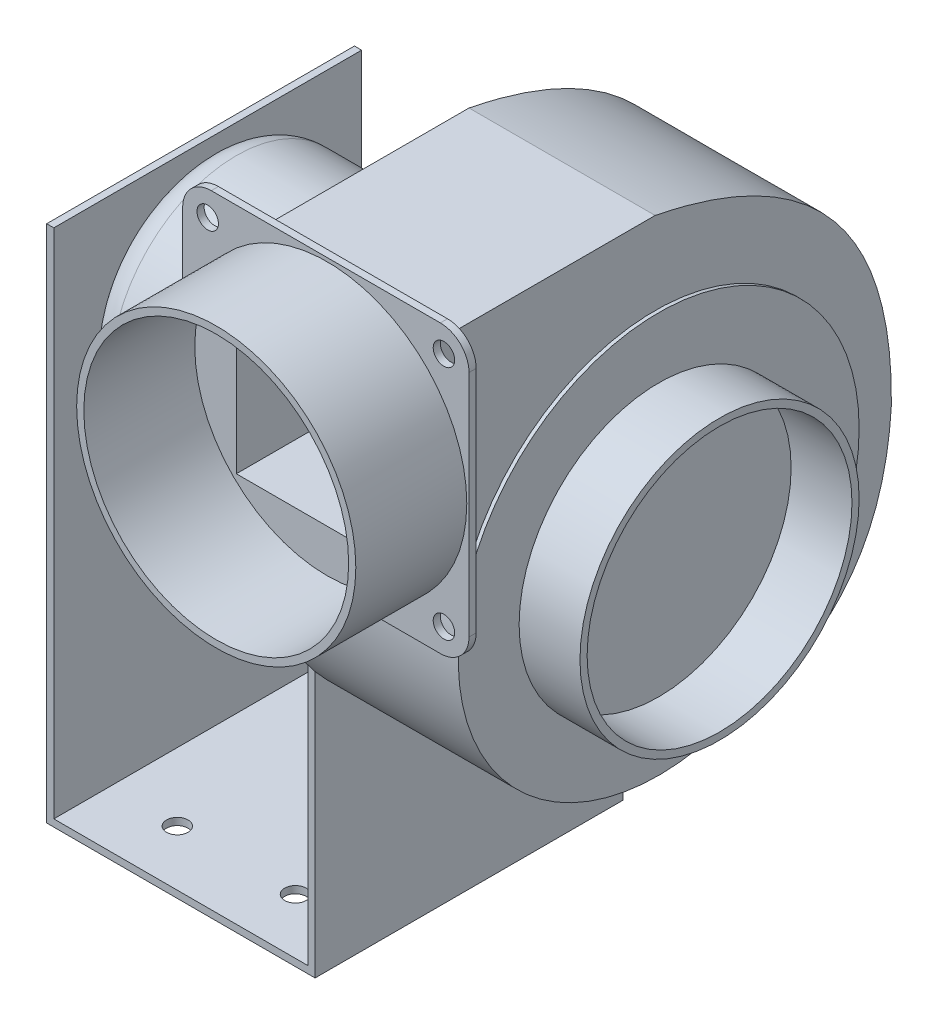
ISO-10303-21;
HEADER;
FILE_DESCRIPTION(('STEP AP214'),'2;1');
FILE_NAME('part.step','',(''),(''),'','','');
FILE_SCHEMA(('AUTOMOTIVE_DESIGN { 1 0 10303 214 1 1 1 1 }'));
ENDSEC;
DATA;
#1=APPLICATION_CONTEXT('core data for automotive mechanical design processes');
#2=APPLICATION_PROTOCOL_DEFINITION('international standard','automotive_design',2000,#1);
#3=PRODUCT_CONTEXT('',#1,'mechanical');
#4=PRODUCT('Part','Part','',(#3));
#5=PRODUCT_RELATED_PRODUCT_CATEGORY('part','',(#4));
#6=PRODUCT_DEFINITION_FORMATION('','',#4);
#7=PRODUCT_DEFINITION_CONTEXT('part definition',#1,'design');
#8=PRODUCT_DEFINITION('design','',#6,#7);
#9=PRODUCT_DEFINITION_SHAPE('','',#8);
#10=(LENGTH_UNIT() NAMED_UNIT(*) SI_UNIT(.MILLI.,.METRE.));
#11=(NAMED_UNIT(*) PLANE_ANGLE_UNIT() SI_UNIT($,.RADIAN.));
#12=(NAMED_UNIT(*) SI_UNIT($,.STERADIAN.) SOLID_ANGLE_UNIT());
#13=UNCERTAINTY_MEASURE_WITH_UNIT(LENGTH_MEASURE(1.E-05),#10,'distance_accuracy_value','');
#14=(GEOMETRIC_REPRESENTATION_CONTEXT(3) GLOBAL_UNCERTAINTY_ASSIGNED_CONTEXT((#13)) GLOBAL_UNIT_ASSIGNED_CONTEXT((#10,
#11,#12)) REPRESENTATION_CONTEXT('',''));
#15=CARTESIAN_POINT('',(0.,0.,0.));
#16=DIRECTION('',(0.,0.,1.));
#17=DIRECTION('',(1.,0.,0.));
#18=AXIS2_PLACEMENT_3D('',#15,#16,#17);
#19=CARTESIAN_POINT('',(0.,52.6511777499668,-49.9638222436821));
#20=DIRECTION('',(1.,0.,0.));
#21=DIRECTION('',(0.,0.,-1.));
#22=AXIS2_PLACEMENT_3D('',#19,#20,#21);
#23=PLANE('',#22);
#24=DIRECTION('',(0.,-1.,0.));
#25=VECTOR('',#24,1.);
#26=CARTESIAN_POINT('',(0.,35.,-43.));
#27=LINE('',#26,#25);
#28=CARTESIAN_POINT('',(0.,35.,-43.));
#29=VERTEX_POINT('',#28);
#30=CARTESIAN_POINT('',(0.,-46.4801190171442,-42.9999999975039));
#31=VERTEX_POINT('',#30);
#32=EDGE_CURVE('E50',#29,#31,#27,.T.);
#33=ORIENTED_EDGE('',*,*,#32,.F.);
#34=DIRECTION('',(0.,0.,-1.));
#35=VECTOR('',#34,1.);
#36=CARTESIAN_POINT('',(0.,35.,-43.));
#37=LINE('',#36,#35);
#38=CARTESIAN_POINT('',(0.,35.,43.));
#39=VERTEX_POINT('',#38);
#40=EDGE_CURVE('E282',#39,#29,#37,.T.);
#41=ORIENTED_EDGE('',*,*,#40,.F.);
#42=DIRECTION('',(0.,-1.,0.));
#43=VECTOR('',#42,1.);
#44=CARTESIAN_POINT('',(0.,35.,43.));
#45=LINE('',#44,#43);
#46=CARTESIAN_POINT('',(0.,-35.8747822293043,43.));
#47=VERTEX_POINT('',#46);
#48=EDGE_CURVE('E228',#39,#47,#45,.T.);
#49=ORIENTED_EDGE('',*,*,#48,.T.);
#50=CARTESIAN_POINT('',(0.,0.,0.));
#51=DIRECTION('',(1.,0.,0.));
#52=DIRECTION('',(0.,0.,-1.));
#53=AXIS2_PLACEMENT_3D('',#50,#51,#52);
#54=CIRCLE('',#53,56.);
#55=CARTESIAN_POINT('',(0.,19.,52.6782687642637));
#56=VERTEX_POINT('',#55);
#57=EDGE_CURVE('E490',#56,#47,#54,.T.);
#58=ORIENTED_EDGE('',*,*,#57,.F.);
#59=DIRECTION('',(0.,0.,-1.));
#60=VECTOR('',#59,1.);
#61=CARTESIAN_POINT('',(0.,19.,64.));
#62=LINE('',#61,#60);
#63=CARTESIAN_POINT('',(0.,19.,64.));
#64=VERTEX_POINT('',#63);
#65=EDGE_CURVE('E488',#64,#56,#62,.T.);
#66=ORIENTED_EDGE('',*,*,#65,.F.);
#67=DIRECTION('',(0.,-1.,0.));
#68=VECTOR('',#67,1.);
#69=CARTESIAN_POINT('',(0.,79.,64.));
#70=LINE('',#69,#68);
#71=CARTESIAN_POINT('',(0.,79.,64.));
#72=VERTEX_POINT('',#71);
#73=EDGE_CURVE('E485',#72,#64,#70,.T.);
#74=ORIENTED_EDGE('',*,*,#73,.F.);
#75=DIRECTION('',(0.,0.,1.));
#76=VECTOR('',#75,1.);
#77=CARTESIAN_POINT('',(0.,79.,0.));
#78=LINE('',#77,#76);
#79=CARTESIAN_POINT('',(0.,79.,0.));
#80=VERTEX_POINT('',#79);
#81=EDGE_CURVE('E480',#80,#72,#78,.T.);
#82=ORIENTED_EDGE('',*,*,#81,.F.);
#83=CARTESIAN_POINT('',(0.,0.,-66.));
#84=CARTESIAN_POINT('',(0.,65.8023554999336,-66.9276444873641));
#85=CARTESIAN_POINT('',(0.,79.,0.));
#86=B_SPLINE_CURVE_WITH_KNOTS('',2,(#83,#84,#85),.UNSPECIFIED.,.F.,.F.,(3,3),(0.,1.),.UNSPECIFIED.);
#87=CARTESIAN_POINT('',(0.,0.,-66.));
#88=VERTEX_POINT('',#87);
#89=EDGE_CURVE('E428',#88,#80,#86,.T.);
#90=ORIENTED_EDGE('',*,*,#89,.F.);
#91=CARTESIAN_POINT('',(0.,-56.,0.));
#92=CARTESIAN_POINT('',(0.,-57.8373750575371,-62.6147042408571));
#93=CARTESIAN_POINT('',(0.,0.,-66.));
#94=B_SPLINE_CURVE_WITH_KNOTS('',2,(#91,#92,#93),.UNSPECIFIED.,.F.,.F.,(3,3),(0.,1.),.UNSPECIFIED.);
#95=EDGE_CURVE('E493',#31,#88,#94,.T.);
#96=ORIENTED_EDGE('',*,*,#95,.F.);
#97=EDGE_LOOP('',(#33,#41,#49,#58,#66,#74,#82,#90,#96));
#98=FACE_BOUND('',#97,.T.);
#99=ADVANCED_FACE('F35',(#98),#23,.F.);
#100=CARTESIAN_POINT('',(-5.99999999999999,17.,66.));
#101=DIRECTION('',(0.,0.,-1.));
#102=DIRECTION('',(-1.,0.,0.));
#103=AXIS2_PLACEMENT_3D('',#100,#101,#102);
#104=PLANE('',#103);
#105=CARTESIAN_POINT('',(-6.99999999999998,16.,66.));
#106=DIRECTION('',(0.,0.,1.));
#107=DIRECTION('',(1.,0.,0.));
#108=AXIS2_PLACEMENT_3D('',#105,#106,#107);
#109=CIRCLE('',#108,3.);
#110=CARTESIAN_POINT('',(-3.99999999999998,16.,66.));
#111=VERTEX_POINT('',#110);
#112=EDGE_CURVE('E346',#111,#111,#109,.T.);
#113=ORIENTED_EDGE('',*,*,#112,.F.);
#114=EDGE_LOOP('',(#113));
#115=FACE_BOUND('',#114,.T.);
#116=CARTESIAN_POINT('',(59.,16.,66.));
#117=DIRECTION('',(0.,0.,1.));
#118=DIRECTION('',(1.,0.,0.));
#119=AXIS2_PLACEMENT_3D('',#116,#117,#118);
#120=CIRCLE('',#119,3.);
#121=CARTESIAN_POINT('',(62.,16.,66.));
#122=VERTEX_POINT('',#121);
#123=EDGE_CURVE('E350',#122,#122,#120,.T.);
#124=ORIENTED_EDGE('',*,*,#123,.F.);
#125=EDGE_LOOP('',(#124));
#126=FACE_BOUND('',#125,.T.);
#127=CARTESIAN_POINT('',(59.,82.,66.));
#128=DIRECTION('',(0.,0.,1.));
#129=DIRECTION('',(1.,0.,0.));
#130=AXIS2_PLACEMENT_3D('',#127,#128,#129);
#131=CIRCLE('',#130,3.);
#132=CARTESIAN_POINT('',(62.,82.,66.));
#133=VERTEX_POINT('',#132);
#134=EDGE_CURVE('E356',#133,#133,#131,.T.);
#135=ORIENTED_EDGE('',*,*,#134,.F.);
#136=EDGE_LOOP('',(#135));
#137=FACE_BOUND('',#136,.T.);
#138=CARTESIAN_POINT('',(-6.99999999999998,82.,66.));
#139=DIRECTION('',(0.,0.,1.));
#140=DIRECTION('',(1.,0.,0.));
#141=AXIS2_PLACEMENT_3D('',#138,#139,#140);
#142=CIRCLE('',#141,3.);
#143=CARTESIAN_POINT('',(-3.99999999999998,82.,66.));
#144=VERTEX_POINT('',#143);
#145=EDGE_CURVE('E362',#144,#144,#142,.T.);
#146=ORIENTED_EDGE('',*,*,#145,.F.);
#147=EDGE_LOOP('',(#146));
#148=FACE_BOUND('',#147,.T.);
#149=CARTESIAN_POINT('',(-5.99999999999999,17.,66.));
#150=DIRECTION('',(0.,0.,1.));
#151=DIRECTION('',(-1.,0.,0.));
#152=AXIS2_PLACEMENT_3D('',#149,#150,#151);
#153=CIRCLE('',#152,8.);
#154=CARTESIAN_POINT('',(-14.,17.0000000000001,66.));
#155=VERTEX_POINT('',#154);
#156=CARTESIAN_POINT('',(-5.99999999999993,9.,66.));
#157=VERTEX_POINT('',#156);
#158=EDGE_CURVE('E371',#155,#157,#153,.T.);
#159=ORIENTED_EDGE('',*,*,#158,.T.);
#160=DIRECTION('',(1.,0.,0.));
#161=VECTOR('',#160,1.);
#162=CARTESIAN_POINT('',(-5.99999999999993,9.,66.));
#163=LINE('',#162,#161);
#164=CARTESIAN_POINT('',(58.,9.,66.));
#165=VERTEX_POINT('',#164);
#166=EDGE_CURVE('E374',#157,#165,#163,.T.);
#167=ORIENTED_EDGE('',*,*,#166,.T.);
#168=CARTESIAN_POINT('',(58.,17.,66.));
#169=DIRECTION('',(0.,0.,1.));
#170=DIRECTION('',(1.,0.,0.));
#171=AXIS2_PLACEMENT_3D('',#168,#169,#170);
#172=CIRCLE('',#171,8.);
#173=CARTESIAN_POINT('',(66.,17.0000000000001,66.));
#174=VERTEX_POINT('',#173);
#175=EDGE_CURVE('E377',#165,#174,#172,.T.);
#176=ORIENTED_EDGE('',*,*,#175,.T.);
#177=DIRECTION('',(0.,1.,0.));
#178=VECTOR('',#177,1.);
#179=CARTESIAN_POINT('',(66.,17.0000000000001,66.));
#180=LINE('',#179,#178);
#181=CARTESIAN_POINT('',(66.,80.9999999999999,66.));
#182=VERTEX_POINT('',#181);
#183=EDGE_CURVE('E379',#174,#182,#180,.T.);
#184=ORIENTED_EDGE('',*,*,#183,.T.);
#185=CARTESIAN_POINT('',(58.,81.,66.));
#186=DIRECTION('',(0.,0.,1.));
#187=DIRECTION('',(-1.,0.,0.));
#188=AXIS2_PLACEMENT_3D('',#185,#186,#187);
#189=CIRCLE('',#188,8.);
#190=CARTESIAN_POINT('',(58.,89.,66.));
#191=VERTEX_POINT('',#190);
#192=EDGE_CURVE('E381',#182,#191,#189,.T.);
#193=ORIENTED_EDGE('',*,*,#192,.T.);
#194=DIRECTION('',(-1.,0.,0.));
#195=VECTOR('',#194,1.);
#196=CARTESIAN_POINT('',(-5.99999999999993,89.,66.));
#197=LINE('',#196,#195);
#198=CARTESIAN_POINT('',(-5.99999999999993,89.,66.));
#199=VERTEX_POINT('',#198);
#200=EDGE_CURVE('E383',#191,#199,#197,.T.);
#201=ORIENTED_EDGE('',*,*,#200,.T.);
#202=CARTESIAN_POINT('',(-5.99999999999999,81.,66.));
#203=DIRECTION('',(0.,0.,1.));
#204=DIRECTION('',(-1.,0.,0.));
#205=AXIS2_PLACEMENT_3D('',#202,#203,#204);
#206=CIRCLE('',#205,8.);
#207=CARTESIAN_POINT('',(-14.,80.9999999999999,66.));
#208=VERTEX_POINT('',#207);
#209=EDGE_CURVE('E385',#199,#208,#206,.T.);
#210=ORIENTED_EDGE('',*,*,#209,.T.);
#211=DIRECTION('',(0.,-1.,0.));
#212=VECTOR('',#211,1.);
#213=CARTESIAN_POINT('',(-14.,17.0000000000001,66.));
#214=LINE('',#213,#212);
#215=EDGE_CURVE('E387',#208,#155,#214,.T.);
#216=ORIENTED_EDGE('',*,*,#215,.T.);
#217=EDGE_LOOP('',(#159,#167,#176,#184,#193,#201,#210,#216));
#218=FACE_BOUND('',#217,.T.);
#219=CARTESIAN_POINT('',(26.3820256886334,49.,66.));
#220=DIRECTION('',(0.,0.,-1.));
#221=DIRECTION('',(-1.,0.,0.));
#222=AXIS2_PLACEMENT_3D('',#219,#220,#221);
#223=CIRCLE('',#222,39.);
#224=CARTESIAN_POINT('',(-12.6179743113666,49.,66.));
#225=VERTEX_POINT('',#224);
#226=EDGE_CURVE('E43',#225,#225,#223,.F.);
#227=ORIENTED_EDGE('',*,*,#226,.F.);
#228=EDGE_LOOP('',(#227));
#229=FACE_BOUND('',#228,.T.);
#230=ADVANCED_FACE('F533',(#115,#126,#137,#148,#218,#229),#104,.F.);
#231=CARTESIAN_POINT('',(53.,0.,0.));
#232=DIRECTION('',(1.,0.,0.));
#233=DIRECTION('',(0.,0.,-1.));
#234=AXIS2_PLACEMENT_3D('',#231,#232,#233);
#235=PLANE('',#234);
#236=CARTESIAN_POINT('',(53.,0.,0.));
#237=DIRECTION('',(1.,0.,0.));
#238=DIRECTION('',(0.,0.,-1.));
#239=AXIS2_PLACEMENT_3D('',#236,#237,#238);
#240=CIRCLE('',#239,56.);
#241=CARTESIAN_POINT('',(53.,0.,-56.));
#242=VERTEX_POINT('',#241);
#243=EDGE_CURVE('E341',#242,#242,#240,.T.);
#244=ORIENTED_EDGE('',*,*,#243,.T.);
#245=EDGE_LOOP('',(#244));
#246=FACE_BOUND('',#245,.T.);
#247=CARTESIAN_POINT('',(53.,0.,0.));
#248=DIRECTION('',(1.,0.,0.));
#249=DIRECTION('',(0.,0.,-1.));
#250=AXIS2_PLACEMENT_3D('',#247,#248,#249);
#251=CIRCLE('',#250,39.);
#252=CARTESIAN_POINT('',(53.,0.,-39.));
#253=VERTEX_POINT('',#252);
#254=EDGE_CURVE('E337',#253,#253,#251,.T.);
#255=ORIENTED_EDGE('',*,*,#254,.F.);
#256=EDGE_LOOP('',(#255));
#257=FACE_BOUND('',#256,.T.);
#258=ADVANCED_FACE('F535',(#246,#257),#235,.T.);
#259=CARTESIAN_POINT('',(52.,52.6511777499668,-49.9638222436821));
#260=DIRECTION('',(1.,0.,0.));
#261=DIRECTION('',(0.,0.,-1.));
#262=AXIS2_PLACEMENT_3D('',#259,#260,#261);
#263=PLANE('',#262);
#264=DIRECTION('',(0.,0.,-1.));
#265=VECTOR('',#264,1.);
#266=CARTESIAN_POINT('',(52.,19.,64.));
#267=LINE('',#266,#265);
#268=CARTESIAN_POINT('',(52.,19.,64.));
#269=VERTEX_POINT('',#268);
#270=CARTESIAN_POINT('',(52.,19.,52.6782687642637));
#271=VERTEX_POINT('',#270);
#272=EDGE_CURVE('E472',#269,#271,#267,.T.);
#273=ORIENTED_EDGE('',*,*,#272,.T.);
#274=CARTESIAN_POINT('',(52.,0.,0.));
#275=DIRECTION('',(1.,0.,0.));
#276=DIRECTION('',(0.,0.,-1.));
#277=AXIS2_PLACEMENT_3D('',#274,#275,#276);
#278=CIRCLE('',#277,56.);
#279=CARTESIAN_POINT('',(52.,-56.,0.));
#280=VERTEX_POINT('',#279);
#281=EDGE_CURVE('E518',#271,#280,#278,.F.);
#282=ORIENTED_EDGE('',*,*,#281,.T.);
#283=CARTESIAN_POINT('',(52.,-56.,0.));
#284=CARTESIAN_POINT('',(52.,-57.8373750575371,-62.6147042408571));
#285=CARTESIAN_POINT('',(52.,0.,-66.));
#286=B_SPLINE_CURVE_WITH_KNOTS('',2,(#283,#284,#285),.UNSPECIFIED.,.F.,.F.,(3,3),(0.,1.),.UNSPECIFIED.);
#287=CARTESIAN_POINT('',(52.,0.,-66.));
#288=VERTEX_POINT('',#287);
#289=EDGE_CURVE('E465',#280,#288,#286,.T.);
#290=ORIENTED_EDGE('',*,*,#289,.T.);
#291=CARTESIAN_POINT('',(52.,0.,-66.));
#292=CARTESIAN_POINT('',(52.,65.8023554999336,-66.9276444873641));
#293=CARTESIAN_POINT('',(52.,79.,0.));
#294=B_SPLINE_CURVE_WITH_KNOTS('',2,(#291,#292,#293),.UNSPECIFIED.,.F.,.F.,(3,3),(0.,1.),.UNSPECIFIED.);
#295=CARTESIAN_POINT('',(52.,79.,0.));
#296=VERTEX_POINT('',#295);
#297=EDGE_CURVE('E429',#288,#296,#294,.T.);
#298=ORIENTED_EDGE('',*,*,#297,.T.);
#299=DIRECTION('',(0.,0.,1.));
#300=VECTOR('',#299,1.);
#301=CARTESIAN_POINT('',(52.,79.,0.));
#302=LINE('',#301,#300);
#303=CARTESIAN_POINT('',(52.,79.,64.));
#304=VERTEX_POINT('',#303);
#305=EDGE_CURVE('E435',#296,#304,#302,.T.);
#306=ORIENTED_EDGE('',*,*,#305,.T.);
#307=DIRECTION('',(0.,-1.,0.));
#308=VECTOR('',#307,1.);
#309=CARTESIAN_POINT('',(52.,79.,64.));
#310=LINE('',#309,#308);
#311=EDGE_CURVE('E705',#304,#269,#310,.T.);
#312=ORIENTED_EDGE('',*,*,#311,.T.);
#313=EDGE_LOOP('',(#273,#282,#290,#298,#306,#312));
#314=FACE_BOUND('',#313,.T.);
#315=ADVANCED_FACE('F445',(#314),#263,.T.);
#316=DIRECTION('',(-1.,0.,0.));
#317=VECTOR('',#316,1.);
#318=SURFACE_OF_LINEAR_EXTRUSION('',#294,#317);
#319=ORIENTED_EDGE('',*,*,#89,.T.);
#320=DIRECTION('',(-1.,0.,0.));
#321=VECTOR('',#320,1.);
#322=CARTESIAN_POINT('',(52.,79.,0.));
#323=LINE('',#322,#321);
#324=EDGE_CURVE('E515',#296,#80,#323,.T.);
#325=ORIENTED_EDGE('',*,*,#324,.F.);
#326=ORIENTED_EDGE('',*,*,#297,.F.);
#327=DIRECTION('',(-1.,0.,0.));
#328=VECTOR('',#327,1.);
#329=CARTESIAN_POINT('',(52.,0.,-66.));
#330=LINE('',#329,#328);
#331=EDGE_CURVE('E471',#288,#88,#330,.T.);
#332=ORIENTED_EDGE('',*,*,#331,.T.);
#333=EDGE_LOOP('',(#319,#325,#326,#332));
#334=FACE_BOUND('',#333,.T.);
#335=ADVANCED_FACE('F441',(#334),#318,.F.);
#336=CARTESIAN_POINT('',(52.,79.,0.));
#337=DIRECTION('',(0.,-1.,0.));
#338=DIRECTION('',(0.,0.,-1.));
#339=AXIS2_PLACEMENT_3D('',#336,#337,#338);
#340=PLANE('',#339);
#341=ORIENTED_EDGE('',*,*,#81,.T.);
#342=DIRECTION('',(-1.,0.,0.));
#343=VECTOR('',#342,1.);
#344=CARTESIAN_POINT('',(52.,79.,64.));
#345=LINE('',#344,#343);
#346=EDGE_CURVE('E512',#304,#72,#345,.T.);
#347=ORIENTED_EDGE('',*,*,#346,.F.);
#348=ORIENTED_EDGE('',*,*,#305,.F.);
#349=ORIENTED_EDGE('',*,*,#324,.T.);
#350=EDGE_LOOP('',(#341,#347,#348,#349));
#351=FACE_BOUND('',#350,.T.);
#352=ADVANCED_FACE('F444',(#351),#340,.F.);
#353=CARTESIAN_POINT('',(52.,19.,64.));
#354=DIRECTION('',(0.,1.,0.));
#355=DIRECTION('',(0.,0.,1.));
#356=AXIS2_PLACEMENT_3D('',#353,#354,#355);
#357=PLANE('',#356);
#358=ORIENTED_EDGE('',*,*,#65,.T.);
#359=DIRECTION('',(-1.,0.,0.));
#360=VECTOR('',#359,1.);
#361=CARTESIAN_POINT('',(52.,19.,52.6782687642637));
#362=LINE('',#361,#360);
#363=EDGE_CURVE('E506',#271,#56,#362,.T.);
#364=ORIENTED_EDGE('',*,*,#363,.F.);
#365=ORIENTED_EDGE('',*,*,#272,.F.);
#366=DIRECTION('',(-1.,0.,0.));
#367=VECTOR('',#366,1.);
#368=CARTESIAN_POINT('',(52.,19.,64.));
#369=LINE('',#368,#367);
#370=EDGE_CURVE('E509',#269,#64,#369,.T.);
#371=ORIENTED_EDGE('',*,*,#370,.T.);
#372=EDGE_LOOP('',(#358,#364,#365,#371));
#373=FACE_BOUND('',#372,.T.);
#374=ADVANCED_FACE('F449',(#373),#357,.F.);
#375=CARTESIAN_POINT('',(52.,0.,0.));
#376=DIRECTION('',(-1.,0.,0.));
#377=DIRECTION('',(0.,0.,1.));
#378=AXIS2_PLACEMENT_3D('',#375,#376,#377);
#379=CYLINDRICAL_SURFACE('',#378,56.);
#380=ORIENTED_EDGE('',*,*,#57,.T.);
#381=CARTESIAN_POINT('',(0.,0.,0.));
#382=DIRECTION('',(-1.,0.,0.));
#383=DIRECTION('',(0.,0.,1.));
#384=AXIS2_PLACEMENT_3D('',#381,#382,#383);
#385=CIRCLE('',#384,56.);
#386=CARTESIAN_POINT('',(0.,-56.,0.));
#387=VERTEX_POINT('',#386);
#388=EDGE_CURVE('E224',#387,#47,#385,.T.);
#389=ORIENTED_EDGE('',*,*,#388,.F.);
#390=DIRECTION('',(-1.,0.,0.));
#391=VECTOR('',#390,1.);
#392=CARTESIAN_POINT('',(52.,-56.,0.));
#393=LINE('',#392,#391);
#394=EDGE_CURVE('E503',#280,#387,#393,.T.);
#395=ORIENTED_EDGE('',*,*,#394,.F.);
#396=ORIENTED_EDGE('',*,*,#281,.F.);
#397=ORIENTED_EDGE('',*,*,#363,.T.);
#398=EDGE_LOOP('',(#380,#389,#395,#396,#397));
#399=FACE_BOUND('',#398,.T.);
#400=ORIENTED_EDGE('',*,*,#243,.F.);
#401=EDGE_LOOP('',(#400));
#402=FACE_BOUND('',#401,.T.);
#403=ADVANCED_FACE('F453',(#399,#402),#379,.T.);
#404=DIRECTION('',(-1.,0.,0.));
#405=VECTOR('',#404,1.);
#406=SURFACE_OF_LINEAR_EXTRUSION('',#286,#405);
#407=EDGE_CURVE('E436',#387,#31,#94,.T.);
#408=ORIENTED_EDGE('',*,*,#407,.T.);
#409=ORIENTED_EDGE('',*,*,#95,.T.);
#410=ORIENTED_EDGE('',*,*,#331,.F.);
#411=ORIENTED_EDGE('',*,*,#289,.F.);
#412=ORIENTED_EDGE('',*,*,#394,.T.);
#413=EDGE_LOOP('',(#408,#409,#410,#411,#412));
#414=FACE_BOUND('',#413,.T.);
#415=ADVANCED_FACE('F457',(#414),#406,.F.);
#416=CARTESIAN_POINT('',(-5.99999999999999,17.,66.));
#417=DIRECTION('',(0.,0.,-1.));
#418=DIRECTION('',(-1.,0.,0.));
#419=AXIS2_PLACEMENT_3D('',#416,#417,#418);
#420=CYLINDRICAL_SURFACE('',#419,8.);
#421=CARTESIAN_POINT('',(-5.99999999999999,17.,64.));
#422=DIRECTION('',(0.,0.,1.));
#423=DIRECTION('',(-1.,0.,0.));
#424=AXIS2_PLACEMENT_3D('',#421,#422,#423);
#425=CIRCLE('',#424,8.);
#426=CARTESIAN_POINT('',(-14.,17.0000000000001,64.));
#427=VERTEX_POINT('',#426);
#428=CARTESIAN_POINT('',(-5.99999999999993,9.,64.));
#429=VERTEX_POINT('',#428);
#430=EDGE_CURVE('E368',#427,#429,#425,.T.);
#431=ORIENTED_EDGE('',*,*,#430,.T.);
#432=DIRECTION('',(0.,0.,-1.));
#433=VECTOR('',#432,1.);
#434=CARTESIAN_POINT('',(-5.99999999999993,9.,66.));
#435=LINE('',#434,#433);
#436=EDGE_CURVE('E425',#157,#429,#435,.T.);
#437=ORIENTED_EDGE('',*,*,#436,.F.);
#438=ORIENTED_EDGE('',*,*,#158,.F.);
#439=DIRECTION('',(0.,0.,-1.));
#440=VECTOR('',#439,1.);
#441=CARTESIAN_POINT('',(-14.,17.0000000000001,66.));
#442=LINE('',#441,#440);
#443=EDGE_CURVE('E389',#155,#427,#442,.T.);
#444=ORIENTED_EDGE('',*,*,#443,.T.);
#445=EDGE_LOOP('',(#431,#437,#438,#444));
#446=FACE_BOUND('',#445,.T.);
#447=ADVANCED_FACE('F462',(#446),#420,.T.);
#448=CARTESIAN_POINT('',(-5.99999999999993,9.,66.));
#449=DIRECTION('',(0.,1.,0.));
#450=DIRECTION('',(0.,0.,1.));
#451=AXIS2_PLACEMENT_3D('',#448,#449,#450);
#452=PLANE('',#451);
#453=DIRECTION('',(1.,0.,0.));
#454=VECTOR('',#453,1.);
#455=CARTESIAN_POINT('',(-5.99999999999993,9.,64.));
#456=LINE('',#455,#454);
#457=CARTESIAN_POINT('',(58.,9.,64.));
#458=VERTEX_POINT('',#457);
#459=EDGE_CURVE('E392',#429,#458,#456,.T.);
#460=ORIENTED_EDGE('',*,*,#459,.T.);
#461=DIRECTION('',(0.,0.,-1.));
#462=VECTOR('',#461,1.);
#463=CARTESIAN_POINT('',(58.,9.,66.));
#464=LINE('',#463,#462);
#465=EDGE_CURVE('E422',#165,#458,#464,.T.);
#466=ORIENTED_EDGE('',*,*,#465,.F.);
#467=ORIENTED_EDGE('',*,*,#166,.F.);
#468=ORIENTED_EDGE('',*,*,#436,.T.);
#469=EDGE_LOOP('',(#460,#466,#467,#468));
#470=FACE_BOUND('',#469,.T.);
#471=ADVANCED_FACE('F648',(#470),#452,.F.);
#472=CARTESIAN_POINT('',(58.,17.,66.));
#473=DIRECTION('',(0.,0.,-1.));
#474=DIRECTION('',(-1.,0.,0.));
#475=AXIS2_PLACEMENT_3D('',#472,#473,#474);
#476=CYLINDRICAL_SURFACE('',#475,8.);
#477=CARTESIAN_POINT('',(58.,17.,64.));
#478=DIRECTION('',(0.,0.,1.));
#479=DIRECTION('',(1.,0.,0.));
#480=AXIS2_PLACEMENT_3D('',#477,#478,#479);
#481=CIRCLE('',#480,8.);
#482=CARTESIAN_POINT('',(66.,17.0000000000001,64.));
#483=VERTEX_POINT('',#482);
#484=EDGE_CURVE('E394',#458,#483,#481,.T.);
#485=ORIENTED_EDGE('',*,*,#484,.T.);
#486=DIRECTION('',(0.,0.,-1.));
#487=VECTOR('',#486,1.);
#488=CARTESIAN_POINT('',(66.,17.0000000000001,66.));
#489=LINE('',#488,#487);
#490=EDGE_CURVE('E419',#174,#483,#489,.T.);
#491=ORIENTED_EDGE('',*,*,#490,.F.);
#492=ORIENTED_EDGE('',*,*,#175,.F.);
#493=ORIENTED_EDGE('',*,*,#465,.T.);
#494=EDGE_LOOP('',(#485,#491,#492,#493));
#495=FACE_BOUND('',#494,.T.);
#496=ADVANCED_FACE('F653',(#495),#476,.T.);
#497=CARTESIAN_POINT('',(66.,17.0000000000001,66.));
#498=DIRECTION('',(-1.,0.,0.));
#499=DIRECTION('',(0.,0.,1.));
#500=AXIS2_PLACEMENT_3D('',#497,#498,#499);
#501=PLANE('',#500);
#502=DIRECTION('',(0.,1.,0.));
#503=VECTOR('',#502,1.);
#504=CARTESIAN_POINT('',(66.,17.0000000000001,64.));
#505=LINE('',#504,#503);
#506=CARTESIAN_POINT('',(66.,80.9999999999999,64.));
#507=VERTEX_POINT('',#506);
#508=EDGE_CURVE('E396',#483,#507,#505,.T.);
#509=ORIENTED_EDGE('',*,*,#508,.T.);
#510=DIRECTION('',(0.,0.,-1.));
#511=VECTOR('',#510,1.);
#512=CARTESIAN_POINT('',(66.,80.9999999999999,66.));
#513=LINE('',#512,#511);
#514=EDGE_CURVE('E416',#182,#507,#513,.T.);
#515=ORIENTED_EDGE('',*,*,#514,.F.);
#516=ORIENTED_EDGE('',*,*,#183,.F.);
#517=ORIENTED_EDGE('',*,*,#490,.T.);
#518=EDGE_LOOP('',(#509,#515,#516,#517));
#519=FACE_BOUND('',#518,.T.);
#520=ADVANCED_FACE('F659',(#519),#501,.F.);
#521=CARTESIAN_POINT('',(58.,81.,66.));
#522=DIRECTION('',(0.,0.,-1.));
#523=DIRECTION('',(-1.,0.,0.));
#524=AXIS2_PLACEMENT_3D('',#521,#522,#523);
#525=CYLINDRICAL_SURFACE('',#524,8.);
#526=CARTESIAN_POINT('',(58.,81.,64.));
#527=DIRECTION('',(0.,0.,1.));
#528=DIRECTION('',(-1.,0.,0.));
#529=AXIS2_PLACEMENT_3D('',#526,#527,#528);
#530=CIRCLE('',#529,8.);
#531=CARTESIAN_POINT('',(58.,89.,64.));
#532=VERTEX_POINT('',#531);
#533=EDGE_CURVE('E398',#507,#532,#530,.T.);
#534=ORIENTED_EDGE('',*,*,#533,.T.);
#535=DIRECTION('',(0.,0.,-1.));
#536=VECTOR('',#535,1.);
#537=CARTESIAN_POINT('',(58.,89.,66.));
#538=LINE('',#537,#536);
#539=EDGE_CURVE('E413',#191,#532,#538,.T.);
#540=ORIENTED_EDGE('',*,*,#539,.F.);
#541=ORIENTED_EDGE('',*,*,#192,.F.);
#542=ORIENTED_EDGE('',*,*,#514,.T.);
#543=EDGE_LOOP('',(#534,#540,#541,#542));
#544=FACE_BOUND('',#543,.T.);
#545=ADVANCED_FACE('F663',(#544),#525,.T.);
#546=CARTESIAN_POINT('',(-5.99999999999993,89.,66.));
#547=DIRECTION('',(0.,-1.,0.));
#548=DIRECTION('',(0.,0.,-1.));
#549=AXIS2_PLACEMENT_3D('',#546,#547,#548);
#550=PLANE('',#549);
#551=DIRECTION('',(-1.,0.,0.));
#552=VECTOR('',#551,1.);
#553=CARTESIAN_POINT('',(-5.99999999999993,89.,64.));
#554=LINE('',#553,#552);
#555=CARTESIAN_POINT('',(-5.99999999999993,89.,64.));
#556=VERTEX_POINT('',#555);
#557=EDGE_CURVE('E400',#532,#556,#554,.T.);
#558=ORIENTED_EDGE('',*,*,#557,.T.);
#559=DIRECTION('',(0.,0.,-1.));
#560=VECTOR('',#559,1.);
#561=CARTESIAN_POINT('',(-5.99999999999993,89.,66.));
#562=LINE('',#561,#560);
#563=EDGE_CURVE('E410',#199,#556,#562,.T.);
#564=ORIENTED_EDGE('',*,*,#563,.F.);
#565=ORIENTED_EDGE('',*,*,#200,.F.);
#566=ORIENTED_EDGE('',*,*,#539,.T.);
#567=EDGE_LOOP('',(#558,#564,#565,#566));
#568=FACE_BOUND('',#567,.T.);
#569=ADVANCED_FACE('F668',(#568),#550,.F.);
#570=CARTESIAN_POINT('',(-5.99999999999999,81.,66.));
#571=DIRECTION('',(0.,0.,-1.));
#572=DIRECTION('',(-1.,0.,0.));
#573=AXIS2_PLACEMENT_3D('',#570,#571,#572);
#574=CYLINDRICAL_SURFACE('',#573,8.);
#575=CARTESIAN_POINT('',(-5.99999999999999,81.,64.));
#576=DIRECTION('',(0.,0.,1.));
#577=DIRECTION('',(-1.,0.,0.));
#578=AXIS2_PLACEMENT_3D('',#575,#576,#577);
#579=CIRCLE('',#578,8.);
#580=CARTESIAN_POINT('',(-14.,80.9999999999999,64.));
#581=VERTEX_POINT('',#580);
#582=EDGE_CURVE('E402',#556,#581,#579,.T.);
#583=ORIENTED_EDGE('',*,*,#582,.T.);
#584=DIRECTION('',(0.,0.,-1.));
#585=VECTOR('',#584,1.);
#586=CARTESIAN_POINT('',(-14.,80.9999999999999,66.));
#587=LINE('',#586,#585);
#588=EDGE_CURVE('E407',#208,#581,#587,.T.);
#589=ORIENTED_EDGE('',*,*,#588,.F.);
#590=ORIENTED_EDGE('',*,*,#209,.F.);
#591=ORIENTED_EDGE('',*,*,#563,.T.);
#592=EDGE_LOOP('',(#583,#589,#590,#591));
#593=FACE_BOUND('',#592,.T.);
#594=ADVANCED_FACE('F672',(#593),#574,.T.);
#595=CARTESIAN_POINT('',(-14.,17.0000000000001,66.));
#596=DIRECTION('',(1.,0.,0.));
#597=DIRECTION('',(0.,0.,-1.));
#598=AXIS2_PLACEMENT_3D('',#595,#596,#597);
#599=PLANE('',#598);
#600=DIRECTION('',(0.,-1.,0.));
#601=VECTOR('',#600,1.);
#602=CARTESIAN_POINT('',(-14.,17.0000000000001,64.));
#603=LINE('',#602,#601);
#604=EDGE_CURVE('E375',#581,#427,#603,.T.);
#605=ORIENTED_EDGE('',*,*,#604,.T.);
#606=ORIENTED_EDGE('',*,*,#443,.F.);
#607=ORIENTED_EDGE('',*,*,#215,.F.);
#608=ORIENTED_EDGE('',*,*,#588,.T.);
#609=EDGE_LOOP('',(#605,#606,#607,#608));
#610=FACE_BOUND('',#609,.T.);
#611=ADVANCED_FACE('F633',(#610),#599,.F.);
#612=CARTESIAN_POINT('',(-5.99999999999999,17.,64.));
#613=DIRECTION('',(0.,0.,-1.));
#614=DIRECTION('',(-1.,0.,0.));
#615=AXIS2_PLACEMENT_3D('',#612,#613,#614);
#616=PLANE('',#615);
#617=CARTESIAN_POINT('',(-6.99999999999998,16.,64.));
#618=DIRECTION('',(0.,0.,1.));
#619=DIRECTION('',(1.,0.,0.));
#620=AXIS2_PLACEMENT_3D('',#617,#618,#619);
#621=CIRCLE('',#620,3.);
#622=CARTESIAN_POINT('',(-3.99999999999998,16.,64.));
#623=VERTEX_POINT('',#622);
#624=EDGE_CURVE('E347',#623,#623,#621,.T.);
#625=ORIENTED_EDGE('',*,*,#624,.T.);
#626=EDGE_LOOP('',(#625));
#627=FACE_BOUND('',#626,.T.);
#628=CARTESIAN_POINT('',(59.,16.,64.));
#629=DIRECTION('',(0.,0.,1.));
#630=DIRECTION('',(1.,0.,0.));
#631=AXIS2_PLACEMENT_3D('',#628,#629,#630);
#632=CIRCLE('',#631,3.);
#633=CARTESIAN_POINT('',(62.,16.,64.));
#634=VERTEX_POINT('',#633);
#635=EDGE_CURVE('E353',#634,#634,#632,.T.);
#636=ORIENTED_EDGE('',*,*,#635,.T.);
#637=EDGE_LOOP('',(#636));
#638=FACE_BOUND('',#637,.T.);
#639=CARTESIAN_POINT('',(59.,82.,64.));
#640=DIRECTION('',(0.,0.,1.));
#641=DIRECTION('',(1.,0.,0.));
#642=AXIS2_PLACEMENT_3D('',#639,#640,#641);
#643=CIRCLE('',#642,3.);
#644=CARTESIAN_POINT('',(62.,82.,64.));
#645=VERTEX_POINT('',#644);
#646=EDGE_CURVE('E359',#645,#645,#643,.T.);
#647=ORIENTED_EDGE('',*,*,#646,.T.);
#648=EDGE_LOOP('',(#647));
#649=FACE_BOUND('',#648,.T.);
#650=CARTESIAN_POINT('',(-6.99999999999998,82.,64.));
#651=DIRECTION('',(0.,0.,1.));
#652=DIRECTION('',(1.,0.,0.));
#653=AXIS2_PLACEMENT_3D('',#650,#651,#652);
#654=CIRCLE('',#653,3.);
#655=CARTESIAN_POINT('',(-3.99999999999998,82.,64.));
#656=VERTEX_POINT('',#655);
#657=EDGE_CURVE('E365',#656,#656,#654,.T.);
#658=ORIENTED_EDGE('',*,*,#657,.T.);
#659=EDGE_LOOP('',(#658));
#660=FACE_BOUND('',#659,.T.);
#661=ORIENTED_EDGE('',*,*,#370,.F.);
#662=ORIENTED_EDGE('',*,*,#311,.F.);
#663=ORIENTED_EDGE('',*,*,#346,.T.);
#664=ORIENTED_EDGE('',*,*,#73,.T.);
#665=EDGE_LOOP('',(#661,#662,#663,#664));
#666=FACE_BOUND('',#665,.T.);
#667=ORIENTED_EDGE('',*,*,#430,.F.);
#668=ORIENTED_EDGE('',*,*,#604,.F.);
#669=ORIENTED_EDGE('',*,*,#582,.F.);
#670=ORIENTED_EDGE('',*,*,#557,.F.);
#671=ORIENTED_EDGE('',*,*,#533,.F.);
#672=ORIENTED_EDGE('',*,*,#508,.F.);
#673=ORIENTED_EDGE('',*,*,#484,.F.);
#674=ORIENTED_EDGE('',*,*,#459,.F.);
#675=EDGE_LOOP('',(#667,#668,#669,#670,#671,#672,#673,#674));
#676=FACE_BOUND('',#675,.T.);
#677=ADVANCED_FACE('F627',(#627,#638,#649,#660,#666,#676),#616,.T.);
#678=CARTESIAN_POINT('',(-6.99999999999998,82.,64.));
#679=DIRECTION('',(0.,0.,1.));
#680=DIRECTION('',(1.,0.,0.));
#681=AXIS2_PLACEMENT_3D('',#678,#679,#680);
#682=CYLINDRICAL_SURFACE('',#681,3.);
#683=ORIENTED_EDGE('',*,*,#657,.F.);
#684=EDGE_LOOP('',(#683));
#685=FACE_BOUND('',#684,.T.);
#686=ORIENTED_EDGE('',*,*,#145,.T.);
#687=EDGE_LOOP('',(#686));
#688=FACE_BOUND('',#687,.T.);
#689=ADVANCED_FACE('F624',(#685,#688),#682,.F.);
#690=CARTESIAN_POINT('',(59.,82.,64.));
#691=DIRECTION('',(0.,0.,1.));
#692=DIRECTION('',(1.,0.,0.));
#693=AXIS2_PLACEMENT_3D('',#690,#691,#692);
#694=CYLINDRICAL_SURFACE('',#693,3.);
#695=ORIENTED_EDGE('',*,*,#646,.F.);
#696=EDGE_LOOP('',(#695));
#697=FACE_BOUND('',#696,.T.);
#698=ORIENTED_EDGE('',*,*,#134,.T.);
#699=EDGE_LOOP('',(#698));
#700=FACE_BOUND('',#699,.T.);
#701=ADVANCED_FACE('F621',(#697,#700),#694,.F.);
#702=CARTESIAN_POINT('',(59.,16.,64.));
#703=DIRECTION('',(0.,0.,1.));
#704=DIRECTION('',(1.,0.,0.));
#705=AXIS2_PLACEMENT_3D('',#702,#703,#704);
#706=CYLINDRICAL_SURFACE('',#705,3.);
#707=ORIENTED_EDGE('',*,*,#635,.F.);
#708=EDGE_LOOP('',(#707));
#709=FACE_BOUND('',#708,.T.);
#710=ORIENTED_EDGE('',*,*,#123,.T.);
#711=EDGE_LOOP('',(#710));
#712=FACE_BOUND('',#711,.T.);
#713=ADVANCED_FACE('F617',(#709,#712),#706,.F.);
#714=CARTESIAN_POINT('',(-6.99999999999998,16.,64.));
#715=DIRECTION('',(0.,0.,1.));
#716=DIRECTION('',(1.,0.,0.));
#717=AXIS2_PLACEMENT_3D('',#714,#715,#716);
#718=CYLINDRICAL_SURFACE('',#717,3.);
#719=ORIENTED_EDGE('',*,*,#624,.F.);
#720=EDGE_LOOP('',(#719));
#721=FACE_BOUND('',#720,.T.);
#722=ORIENTED_EDGE('',*,*,#112,.T.);
#723=EDGE_LOOP('',(#722));
#724=FACE_BOUND('',#723,.T.);
#725=ADVANCED_FACE('F607',(#721,#724),#718,.F.);
#726=CARTESIAN_POINT('',(70.,0.,0.));
#727=DIRECTION('',(1.,0.,0.));
#728=DIRECTION('',(0.,0.,-1.));
#729=AXIS2_PLACEMENT_3D('',#726,#727,#728);
#730=PLANE('',#729);
#731=CARTESIAN_POINT('',(70.,0.,0.));
#732=DIRECTION('',(1.,0.,0.));
#733=DIRECTION('',(0.,0.,-1.));
#734=AXIS2_PLACEMENT_3D('',#731,#732,#733);
#735=CIRCLE('',#734,39.);
#736=CARTESIAN_POINT('',(70.,0.,-39.));
#737=VERTEX_POINT('',#736);
#738=EDGE_CURVE('E338',#737,#737,#735,.T.);
#739=ORIENTED_EDGE('',*,*,#738,.T.);
#740=EDGE_LOOP('',(#739));
#741=FACE_BOUND('',#740,.T.);
#742=CARTESIAN_POINT('',(70.,0.,0.));
#743=DIRECTION('',(1.,0.,0.));
#744=DIRECTION('',(0.,0.,-1.));
#745=AXIS2_PLACEMENT_3D('',#742,#743,#744);
#746=CIRCLE('',#745,37.);
#747=CARTESIAN_POINT('',(70.,0.,-37.));
#748=VERTEX_POINT('',#747);
#749=EDGE_CURVE('E329',#748,#748,#746,.T.);
#750=ORIENTED_EDGE('',*,*,#749,.F.);
#751=EDGE_LOOP('',(#750));
#752=FACE_BOUND('',#751,.T.);
#753=ADVANCED_FACE('F604',(#741,#752),#730,.T.);
#754=CARTESIAN_POINT('',(70.,0.,0.));
#755=DIRECTION('',(-1.,0.,0.));
#756=DIRECTION('',(0.,0.,1.));
#757=AXIS2_PLACEMENT_3D('',#754,#755,#756);
#758=CYLINDRICAL_SURFACE('',#757,39.);
#759=ORIENTED_EDGE('',*,*,#738,.F.);
#760=EDGE_LOOP('',(#759));
#761=FACE_BOUND('',#760,.T.);
#762=ORIENTED_EDGE('',*,*,#254,.T.);
#763=EDGE_LOOP('',(#762));
#764=FACE_BOUND('',#763,.T.);
#765=ADVANCED_FACE('F602',(#761,#764),#758,.T.);
#766=CARTESIAN_POINT('',(70.,0.,0.));
#767=DIRECTION('',(-1.,0.,0.));
#768=DIRECTION('',(0.,0.,1.));
#769=AXIS2_PLACEMENT_3D('',#766,#767,#768);
#770=CYLINDRICAL_SURFACE('',#769,37.);
#771=ORIENTED_EDGE('',*,*,#749,.T.);
#772=EDGE_LOOP('',(#771));
#773=FACE_BOUND('',#772,.T.);
#774=CARTESIAN_POINT('',(53.,0.,0.));
#775=DIRECTION('',(1.,0.,0.));
#776=DIRECTION('',(0.,0.,-1.));
#777=AXIS2_PLACEMENT_3D('',#774,#775,#776);
#778=CIRCLE('',#777,37.);
#779=CARTESIAN_POINT('',(53.,0.,-37.));
#780=VERTEX_POINT('',#779);
#781=EDGE_CURVE('E520',#780,#780,#778,.F.);
#782=ORIENTED_EDGE('',*,*,#781,.T.);
#783=EDGE_LOOP('',(#782));
#784=FACE_BOUND('',#783,.T.);
#785=ADVANCED_FACE('F599',(#773,#784),#770,.F.);
#786=ORIENTED_EDGE('',*,*,#781,.F.);
#787=EDGE_LOOP('',(#786));
#788=FACE_BOUND('',#787,.T.);
#789=ADVANCED_FACE('F546',(#788),#235,.T.);
#790=CARTESIAN_POINT('',(26.3820256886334,49.,97.));
#791=DIRECTION('',(0.,0.,1.));
#792=DIRECTION('',(1.,0.,0.));
#793=AXIS2_PLACEMENT_3D('',#790,#791,#792);
#794=PLANE('',#793);
#795=CARTESIAN_POINT('',(26.3820256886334,49.,97.));
#796=DIRECTION('',(0.,0.,1.));
#797=DIRECTION('',(1.,0.,0.));
#798=AXIS2_PLACEMENT_3D('',#795,#796,#797);
#799=CIRCLE('',#798,39.);
#800=CARTESIAN_POINT('',(65.3820256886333,49.,97.));
#801=VERTEX_POINT('',#800);
#802=EDGE_CURVE('E299',#801,#801,#799,.T.);
#803=ORIENTED_EDGE('',*,*,#802,.T.);
#804=EDGE_LOOP('',(#803));
#805=FACE_BOUND('',#804,.T.);
#806=CARTESIAN_POINT('',(26.3820256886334,49.,97.));
#807=DIRECTION('',(0.,0.,1.));
#808=DIRECTION('',(1.,0.,0.));
#809=AXIS2_PLACEMENT_3D('',#806,#807,#808);
#810=CIRCLE('',#809,37.);
#811=CARTESIAN_POINT('',(63.3820256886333,49.,97.));
#812=VERTEX_POINT('',#811);
#813=EDGE_CURVE('E296',#812,#812,#810,.T.);
#814=ORIENTED_EDGE('',*,*,#813,.F.);
#815=EDGE_LOOP('',(#814));
#816=FACE_BOUND('',#815,.T.);
#817=ADVANCED_FACE('F613',(#805,#816),#794,.T.);
#818=CARTESIAN_POINT('',(26.3820256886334,49.,97.));
#819=DIRECTION('',(0.,0.,-1.));
#820=DIRECTION('',(-1.,0.,0.));
#821=AXIS2_PLACEMENT_3D('',#818,#819,#820);
#822=CYLINDRICAL_SURFACE('',#821,39.);
#823=ORIENTED_EDGE('',*,*,#802,.F.);
#824=EDGE_LOOP('',(#823));
#825=FACE_BOUND('',#824,.T.);
#826=ORIENTED_EDGE('',*,*,#226,.T.);
#827=EDGE_LOOP('',(#826));
#828=FACE_BOUND('',#827,.T.);
#829=ADVANCED_FACE('F531',(#825,#828),#822,.T.);
#830=CARTESIAN_POINT('',(26.3820256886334,49.,97.));
#831=DIRECTION('',(0.,0.,-1.));
#832=DIRECTION('',(-1.,0.,0.));
#833=AXIS2_PLACEMENT_3D('',#830,#831,#832);
#834=CYLINDRICAL_SURFACE('',#833,37.);
#835=ORIENTED_EDGE('',*,*,#813,.T.);
#836=EDGE_LOOP('',(#835));
#837=FACE_BOUND('',#836,.T.);
#838=CARTESIAN_POINT('',(26.3820256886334,49.,66.));
#839=DIRECTION('',(0.,0.,1.));
#840=DIRECTION('',(1.,0.,0.));
#841=AXIS2_PLACEMENT_3D('',#838,#839,#840);
#842=CIRCLE('',#841,37.);
#843=CARTESIAN_POINT('',(63.3820256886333,49.,66.));
#844=VERTEX_POINT('',#843);
#845=EDGE_CURVE('E295',#844,#844,#842,.T.);
#846=ORIENTED_EDGE('',*,*,#845,.F.);
#847=EDGE_LOOP('',(#846));
#848=FACE_BOUND('',#847,.T.);
#849=ADVANCED_FACE('F589',(#837,#848),#834,.F.);
#850=CARTESIAN_POINT('',(0.,0.,-7.00000000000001));
#851=DIRECTION('',(0.,0.,-1.));
#852=DIRECTION('',(-1.,0.,0.));
#853=AXIS2_PLACEMENT_3D('',#850,#851,#852);
#854=PLANE('',#853);
#855=DIRECTION('',(0.,1.,0.));
#856=VECTOR('',#855,1.);
#857=CARTESIAN_POINT('',(51.,24.,-7.00000000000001));
#858=LINE('',#857,#856);
#859=CARTESIAN_POINT('',(51.,24.,-7.00000000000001));
#860=VERTEX_POINT('',#859);
#861=CARTESIAN_POINT('',(51.,74.,-7.00000000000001));
#862=VERTEX_POINT('',#861);
#863=EDGE_CURVE('E304',#860,#862,#858,.T.);
#864=ORIENTED_EDGE('',*,*,#863,.T.);
#865=DIRECTION('',(-1.,0.,0.));
#866=VECTOR('',#865,1.);
#867=CARTESIAN_POINT('',(1.00000000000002,74.,-7.00000000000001));
#868=LINE('',#867,#866);
#869=CARTESIAN_POINT('',(1.00000000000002,74.,-7.00000000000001));
#870=VERTEX_POINT('',#869);
#871=EDGE_CURVE('E307',#862,#870,#868,.T.);
#872=ORIENTED_EDGE('',*,*,#871,.T.);
#873=DIRECTION('',(0.,-1.,0.));
#874=VECTOR('',#873,1.);
#875=CARTESIAN_POINT('',(1.00000000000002,24.,-7.00000000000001));
#876=LINE('',#875,#874);
#877=CARTESIAN_POINT('',(1.00000000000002,24.,-7.00000000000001));
#878=VERTEX_POINT('',#877);
#879=EDGE_CURVE('E311',#870,#878,#876,.T.);
#880=ORIENTED_EDGE('',*,*,#879,.T.);
#881=DIRECTION('',(1.,0.,0.));
#882=VECTOR('',#881,1.);
#883=CARTESIAN_POINT('',(1.00000000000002,24.,-7.00000000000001));
#884=LINE('',#883,#882);
#885=EDGE_CURVE('E314',#878,#860,#884,.T.);
#886=ORIENTED_EDGE('',*,*,#885,.T.);
#887=EDGE_LOOP('',(#864,#872,#880,#886));
#888=FACE_BOUND('',#887,.T.);
#889=ADVANCED_FACE('F577',(#888),#854,.F.);
#890=CARTESIAN_POINT('',(1.00000000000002,24.,-7.00000000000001));
#891=DIRECTION('',(-1.,0.,0.));
#892=DIRECTION('',(0.,0.,1.));
#893=AXIS2_PLACEMENT_3D('',#890,#891,#892);
#894=PLANE('',#893);
#895=DIRECTION('',(0.,-1.,0.));
#896=VECTOR('',#895,1.);
#897=CARTESIAN_POINT('',(1.00000000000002,24.,66.));
#898=LINE('',#897,#896);
#899=CARTESIAN_POINT('',(1.00000000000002,74.,66.));
#900=VERTEX_POINT('',#899);
#901=CARTESIAN_POINT('',(1.00000000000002,24.,66.));
#902=VERTEX_POINT('',#901);
#903=EDGE_CURVE('E322',#900,#902,#898,.T.);
#904=ORIENTED_EDGE('',*,*,#903,.T.);
#905=DIRECTION('',(0.,0.,1.));
#906=VECTOR('',#905,1.);
#907=CARTESIAN_POINT('',(1.00000000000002,24.,-7.00000000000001));
#908=LINE('',#907,#906);
#909=EDGE_CURVE('E330',#878,#902,#908,.T.);
#910=ORIENTED_EDGE('',*,*,#909,.F.);
#911=ORIENTED_EDGE('',*,*,#879,.F.);
#912=DIRECTION('',(0.,0.,1.));
#913=VECTOR('',#912,1.);
#914=CARTESIAN_POINT('',(1.00000000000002,74.,-7.00000000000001));
#915=LINE('',#914,#913);
#916=EDGE_CURVE('E332',#870,#900,#915,.T.);
#917=ORIENTED_EDGE('',*,*,#916,.T.);
#918=EDGE_LOOP('',(#904,#910,#911,#917));
#919=FACE_BOUND('',#918,.T.);
#920=ADVANCED_FACE('F581',(#919),#894,.F.);
#921=CARTESIAN_POINT('',(1.00000000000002,24.,-7.00000000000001));
#922=DIRECTION('',(0.,-1.,0.));
#923=DIRECTION('',(0.,0.,-1.));
#924=AXIS2_PLACEMENT_3D('',#921,#922,#923);
#925=PLANE('',#924);
#926=DIRECTION('',(1.,0.,0.));
#927=VECTOR('',#926,1.);
#928=CARTESIAN_POINT('',(1.00000000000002,24.,66.));
#929=LINE('',#928,#927);
#930=CARTESIAN_POINT('',(51.,24.,66.));
#931=VERTEX_POINT('',#930);
#932=EDGE_CURVE('E308',#902,#931,#929,.T.);
#933=ORIENTED_EDGE('',*,*,#932,.T.);
#934=DIRECTION('',(0.,0.,1.));
#935=VECTOR('',#934,1.);
#936=CARTESIAN_POINT('',(51.,24.,-7.00000000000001));
#937=LINE('',#936,#935);
#938=EDGE_CURVE('E327',#860,#931,#937,.T.);
#939=ORIENTED_EDGE('',*,*,#938,.F.);
#940=ORIENTED_EDGE('',*,*,#885,.F.);
#941=ORIENTED_EDGE('',*,*,#909,.T.);
#942=EDGE_LOOP('',(#933,#939,#940,#941));
#943=FACE_BOUND('',#942,.T.);
#944=ADVANCED_FACE('F579',(#943),#925,.F.);
#945=CARTESIAN_POINT('',(51.,24.,-7.00000000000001));
#946=DIRECTION('',(1.,0.,0.));
#947=DIRECTION('',(0.,0.,-1.));
#948=AXIS2_PLACEMENT_3D('',#945,#946,#947);
#949=PLANE('',#948);
#950=DIRECTION('',(0.,1.,0.));
#951=VECTOR('',#950,1.);
#952=CARTESIAN_POINT('',(51.,24.,66.));
#953=LINE('',#952,#951);
#954=CARTESIAN_POINT('',(51.,74.,66.));
#955=VERTEX_POINT('',#954);
#956=EDGE_CURVE('E58',#931,#955,#953,.T.);
#957=ORIENTED_EDGE('',*,*,#956,.T.);
#958=DIRECTION('',(0.,0.,1.));
#959=VECTOR('',#958,1.);
#960=CARTESIAN_POINT('',(51.,74.,-7.00000000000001));
#961=LINE('',#960,#959);
#962=EDGE_CURVE('E317',#862,#955,#961,.T.);
#963=ORIENTED_EDGE('',*,*,#962,.F.);
#964=ORIENTED_EDGE('',*,*,#863,.F.);
#965=ORIENTED_EDGE('',*,*,#938,.T.);
#966=EDGE_LOOP('',(#957,#963,#964,#965));
#967=FACE_BOUND('',#966,.T.);
#968=ADVANCED_FACE('F564',(#967),#949,.F.);
#969=CARTESIAN_POINT('',(1.00000000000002,74.,-7.00000000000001));
#970=DIRECTION('',(0.,1.,0.));
#971=DIRECTION('',(0.,0.,1.));
#972=AXIS2_PLACEMENT_3D('',#969,#970,#971);
#973=PLANE('',#972);
#974=DIRECTION('',(-1.,0.,0.));
#975=VECTOR('',#974,1.);
#976=CARTESIAN_POINT('',(1.00000000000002,74.,66.));
#977=LINE('',#976,#975);
#978=EDGE_CURVE('E319',#955,#900,#977,.T.);
#979=ORIENTED_EDGE('',*,*,#978,.T.);
#980=ORIENTED_EDGE('',*,*,#916,.F.);
#981=ORIENTED_EDGE('',*,*,#871,.F.);
#982=ORIENTED_EDGE('',*,*,#962,.T.);
#983=EDGE_LOOP('',(#979,#980,#981,#982));
#984=FACE_BOUND('',#983,.T.);
#985=ADVANCED_FACE('F555',(#984),#973,.F.);
#986=ORIENTED_EDGE('',*,*,#845,.T.);
#987=EDGE_LOOP('',(#986));
#988=FACE_BOUND('',#987,.T.);
#989=ORIENTED_EDGE('',*,*,#978,.F.);
#990=ORIENTED_EDGE('',*,*,#956,.F.);
#991=ORIENTED_EDGE('',*,*,#932,.F.);
#992=ORIENTED_EDGE('',*,*,#903,.F.);
#993=EDGE_LOOP('',(#989,#990,#991,#992));
#994=FACE_BOUND('',#993,.T.);
#995=ADVANCED_FACE('F538',(#988,#994),#104,.F.);
#996=CARTESIAN_POINT('',(-2.,35.,43.));
#997=DIRECTION('',(1.,0.,0.));
#998=DIRECTION('',(0.,0.,-1.));
#999=AXIS2_PLACEMENT_3D('',#996,#997,#998);
#1000=PLANE('',#999);
#1001=DIRECTION('',(0.,0.,1.));
#1002=VECTOR('',#1001,1.);
#1003=CARTESIAN_POINT('',(-2.,35.,43.));
#1004=LINE('',#1003,#1002);
#1005=CARTESIAN_POINT('',(-2.,35.,0.));
#1006=VERTEX_POINT('',#1005);
#1007=CARTESIAN_POINT('',(-2.,35.,43.));
#1008=VERTEX_POINT('',#1007);
#1009=EDGE_CURVE('E274',#1006,#1008,#1004,.T.);
#1010=ORIENTED_EDGE('',*,*,#1009,.F.);
#1011=CARTESIAN_POINT('',(-2.,0.,0.));
#1012=DIRECTION('',(1.,0.,0.));
#1013=DIRECTION('',(0.,0.,-1.));
#1014=AXIS2_PLACEMENT_3D('',#1011,#1012,#1013);
#1015=CIRCLE('',#1014,35.);
#1016=EDGE_CURVE('E11',#1006,#1006,#1015,.T.);
#1017=ORIENTED_EDGE('',*,*,#1016,.T.);
#1018=CARTESIAN_POINT('',(-2.,35.,-43.));
#1019=VERTEX_POINT('',#1018);
#1020=EDGE_CURVE('E276',#1019,#1006,#1004,.T.);
#1021=ORIENTED_EDGE('',*,*,#1020,.F.);
#1022=DIRECTION('',(0.,-1.,0.));
#1023=VECTOR('',#1022,1.);
#1024=CARTESIAN_POINT('',(-2.,35.,-43.));
#1025=LINE('',#1024,#1023);
#1026=CARTESIAN_POINT('',(-2.,-108.,-43.));
#1027=VERTEX_POINT('',#1026);
#1028=EDGE_CURVE('E291',#1019,#1027,#1025,.T.);
#1029=ORIENTED_EDGE('',*,*,#1028,.T.);
#1030=DIRECTION('',(0.,0.,1.));
#1031=VECTOR('',#1030,1.);
#1032=CARTESIAN_POINT('',(-2.,-108.,43.));
#1033=LINE('',#1032,#1031);
#1034=CARTESIAN_POINT('',(-2.,-108.,43.));
#1035=VERTEX_POINT('',#1034);
#1036=EDGE_CURVE('E275',#1027,#1035,#1033,.T.);
#1037=ORIENTED_EDGE('',*,*,#1036,.T.);
#1038=DIRECTION('',(0.,-1.,0.));
#1039=VECTOR('',#1038,1.);
#1040=CARTESIAN_POINT('',(-2.,35.,43.));
#1041=LINE('',#1040,#1039);
#1042=EDGE_CURVE('E289',#1008,#1035,#1041,.T.);
#1043=ORIENTED_EDGE('',*,*,#1042,.F.);
#1044=EDGE_LOOP('',(#1010,#1017,#1021,#1029,#1037,#1043));
#1045=FACE_BOUND('',#1044,.T.);
#1046=ADVANCED_FACE('F554',(#1045),#1000,.F.);
#1047=CARTESIAN_POINT('',(0.,35.,-43.));
#1048=DIRECTION('',(-1.,0.,0.));
#1049=DIRECTION('',(0.,0.,1.));
#1050=AXIS2_PLACEMENT_3D('',#1047,#1048,#1049);
#1051=PLANE('',#1050);
#1052=ORIENTED_EDGE('',*,*,#407,.F.);
#1053=ORIENTED_EDGE('',*,*,#388,.T.);
#1054=CARTESIAN_POINT('',(0.,-110.,43.));
#1055=VERTEX_POINT('',#1054);
#1056=EDGE_CURVE('E218',#47,#1055,#45,.T.);
#1057=ORIENTED_EDGE('',*,*,#1056,.T.);
#1058=DIRECTION('',(0.,0.,-1.));
#1059=VECTOR('',#1058,1.);
#1060=CARTESIAN_POINT('',(0.,-110.,43.));
#1061=LINE('',#1060,#1059);
#1062=CARTESIAN_POINT('',(0.,-110.,-43.));
#1063=VERTEX_POINT('',#1062);
#1064=EDGE_CURVE('E222',#1055,#1063,#1061,.T.);
#1065=ORIENTED_EDGE('',*,*,#1064,.T.);
#1066=EDGE_CURVE('E284',#31,#1063,#27,.T.);
#1067=ORIENTED_EDGE('',*,*,#1066,.F.);
#1068=EDGE_LOOP('',(#1052,#1053,#1057,#1065,#1067));
#1069=FACE_BOUND('',#1068,.T.);
#1070=ADVANCED_FACE('F220',(#1069),#1051,.F.);
#1071=CARTESIAN_POINT('',(0.,35.,0.));
#1072=DIRECTION('',(0.,-1.,0.));
#1073=DIRECTION('',(0.,0.,-1.));
#1074=AXIS2_PLACEMENT_3D('',#1071,#1072,#1073);
#1075=PLANE('',#1074);
#1076=ORIENTED_EDGE('',*,*,#1020,.T.);
#1077=ORIENTED_EDGE('',*,*,#1009,.T.);
#1078=DIRECTION('',(1.,0.,0.));
#1079=VECTOR('',#1078,1.);
#1080=CARTESIAN_POINT('',(0.,35.,43.));
#1081=LINE('',#1080,#1079);
#1082=EDGE_CURVE('E279',#1008,#39,#1081,.T.);
#1083=ORIENTED_EDGE('',*,*,#1082,.T.);
#1084=ORIENTED_EDGE('',*,*,#40,.T.);
#1085=DIRECTION('',(-1.,0.,0.));
#1086=VECTOR('',#1085,1.);
#1087=CARTESIAN_POINT('',(-2.,35.,-43.));
#1088=LINE('',#1087,#1086);
#1089=EDGE_CURVE('E271',#29,#1019,#1088,.T.);
#1090=ORIENTED_EDGE('',*,*,#1089,.T.);
#1091=EDGE_LOOP('',(#1076,#1077,#1083,#1084,#1090));
#1092=FACE_BOUND('',#1091,.T.);
#1093=ADVANCED_FACE('F713',(#1092),#1075,.F.);
#1094=CARTESIAN_POINT('',(-2.,35.,-43.));
#1095=DIRECTION('',(0.,0.,1.));
#1096=DIRECTION('',(1.,0.,0.));
#1097=AXIS2_PLACEMENT_3D('',#1094,#1095,#1096);
#1098=PLANE('',#1097);
#1099=ORIENTED_EDGE('',*,*,#1066,.T.);
#1100=DIRECTION('',(1.,0.,0.));
#1101=VECTOR('',#1100,1.);
#1102=CARTESIAN_POINT('',(-75.,-110.,-43.));
#1103=LINE('',#1102,#1101);
#1104=CARTESIAN_POINT('',(-75.,-110.,-43.));
#1105=VERTEX_POINT('',#1104);
#1106=EDGE_CURVE('E240',#1105,#1063,#1103,.T.);
#1107=ORIENTED_EDGE('',*,*,#1106,.F.);
#1108=DIRECTION('',(0.,-1.,0.));
#1109=VECTOR('',#1108,1.);
#1110=CARTESIAN_POINT('',(-75.,35.,-43.));
#1111=LINE('',#1110,#1109);
#1112=CARTESIAN_POINT('',(-75.,35.,-43.));
#1113=VERTEX_POINT('',#1112);
#1114=EDGE_CURVE('E744',#1113,#1105,#1111,.T.);
#1115=ORIENTED_EDGE('',*,*,#1114,.F.);
#1116=DIRECTION('',(1.,0.,0.));
#1117=VECTOR('',#1116,1.);
#1118=CARTESIAN_POINT('',(-75.,35.,-43.));
#1119=LINE('',#1118,#1117);
#1120=CARTESIAN_POINT('',(-73.,35.,-43.));
#1121=VERTEX_POINT('',#1120);
#1122=EDGE_CURVE('E736',#1113,#1121,#1119,.T.);
#1123=ORIENTED_EDGE('',*,*,#1122,.T.);
#1124=DIRECTION('',(0.,-1.,0.));
#1125=VECTOR('',#1124,1.);
#1126=CARTESIAN_POINT('',(-73.,35.,-43.));
#1127=LINE('',#1126,#1125);
#1128=CARTESIAN_POINT('',(-73.,-108.,-43.));
#1129=VERTEX_POINT('',#1128);
#1130=EDGE_CURVE('E263',#1121,#1129,#1127,.T.);
#1131=ORIENTED_EDGE('',*,*,#1130,.T.);
#1132=DIRECTION('',(-1.,0.,0.));
#1133=VECTOR('',#1132,1.);
#1134=CARTESIAN_POINT('',(0.,-108.,-43.));
#1135=LINE('',#1134,#1133);
#1136=EDGE_CURVE('E249',#1027,#1129,#1135,.T.);
#1137=ORIENTED_EDGE('',*,*,#1136,.F.);
#1138=ORIENTED_EDGE('',*,*,#1028,.F.);
#1139=ORIENTED_EDGE('',*,*,#1089,.F.);
#1140=ORIENTED_EDGE('',*,*,#32,.T.);
#1141=EDGE_LOOP('',(#1099,#1107,#1115,#1123,#1131,#1137,#1138,#1139,#1140));
#1142=FACE_BOUND('',#1141,.T.);
#1143=ADVANCED_FACE('F720',(#1142),#1098,.F.);
#1144=CARTESIAN_POINT('',(0.,35.,43.));
#1145=DIRECTION('',(0.,0.,-1.));
#1146=DIRECTION('',(-1.,0.,0.));
#1147=AXIS2_PLACEMENT_3D('',#1144,#1145,#1146);
#1148=PLANE('',#1147);
#1149=ORIENTED_EDGE('',*,*,#1042,.T.);
#1150=DIRECTION('',(-1.,0.,0.));
#1151=VECTOR('',#1150,1.);
#1152=CARTESIAN_POINT('',(0.,-108.,43.));
#1153=LINE('',#1152,#1151);
#1154=CARTESIAN_POINT('',(-73.,-108.,43.));
#1155=VERTEX_POINT('',#1154);
#1156=EDGE_CURVE('E246',#1035,#1155,#1153,.T.);
#1157=ORIENTED_EDGE('',*,*,#1156,.T.);
#1158=DIRECTION('',(0.,1.,0.));
#1159=VECTOR('',#1158,1.);
#1160=CARTESIAN_POINT('',(-73.,35.,43.));
#1161=LINE('',#1160,#1159);
#1162=CARTESIAN_POINT('',(-73.,35.,43.));
#1163=VERTEX_POINT('',#1162);
#1164=EDGE_CURVE('E723',#1155,#1163,#1161,.T.);
#1165=ORIENTED_EDGE('',*,*,#1164,.T.);
#1166=DIRECTION('',(1.,0.,0.));
#1167=VECTOR('',#1166,1.);
#1168=CARTESIAN_POINT('',(-75.,35.,43.));
#1169=LINE('',#1168,#1167);
#1170=CARTESIAN_POINT('',(-75.,35.,43.));
#1171=VERTEX_POINT('',#1170);
#1172=EDGE_CURVE('E287',#1171,#1163,#1169,.T.);
#1173=ORIENTED_EDGE('',*,*,#1172,.F.);
#1174=DIRECTION('',(0.,1.,0.));
#1175=VECTOR('',#1174,1.);
#1176=CARTESIAN_POINT('',(-75.,35.,43.));
#1177=LINE('',#1176,#1175);
#1178=CARTESIAN_POINT('',(-75.,-110.,43.));
#1179=VERTEX_POINT('',#1178);
#1180=EDGE_CURVE('E237',#1179,#1171,#1177,.T.);
#1181=ORIENTED_EDGE('',*,*,#1180,.F.);
#1182=DIRECTION('',(1.,0.,0.));
#1183=VECTOR('',#1182,1.);
#1184=CARTESIAN_POINT('',(-75.,-110.,43.));
#1185=LINE('',#1184,#1183);
#1186=EDGE_CURVE('E232',#1179,#1055,#1185,.T.);
#1187=ORIENTED_EDGE('',*,*,#1186,.T.);
#1188=ORIENTED_EDGE('',*,*,#1056,.F.);
#1189=ORIENTED_EDGE('',*,*,#48,.F.);
#1190=ORIENTED_EDGE('',*,*,#1082,.F.);
#1191=EDGE_LOOP('',(#1149,#1157,#1165,#1173,#1181,#1187,#1188,#1189,#1190));
#1192=FACE_BOUND('',#1191,.T.);
#1193=ADVANCED_FACE('F234',(#1192),#1148,.F.);
#1194=CARTESIAN_POINT('',(-65.,0.,0.));
#1195=DIRECTION('',(-1.,0.,0.));
#1196=DIRECTION('',(0.,0.,1.));
#1197=AXIS2_PLACEMENT_3D('',#1194,#1195,#1196);
#1198=TOROIDAL_SURFACE('',#1197,27.,8.);
#1199=CARTESIAN_POINT('',(-65.,0.,0.));
#1200=DIRECTION('',(-1.,0.,0.));
#1201=DIRECTION('',(0.,0.,1.));
#1202=AXIS2_PLACEMENT_3D('',#1199,#1200,#1201);
#1203=CIRCLE('',#1202,35.);
#1204=CARTESIAN_POINT('',(-65.,0.,35.));
#1205=VERTEX_POINT('',#1204);
#1206=EDGE_CURVE('E526',#1205,#1205,#1203,.F.);
#1207=ORIENTED_EDGE('',*,*,#1206,.F.);
#1208=EDGE_LOOP('',(#1207));
#1209=FACE_BOUND('',#1208,.T.);
#1210=CARTESIAN_POINT('',(-73.,0.,0.));
#1211=DIRECTION('',(-1.,0.,0.));
#1212=DIRECTION('',(0.,0.,1.));
#1213=AXIS2_PLACEMENT_3D('',#1210,#1211,#1212);
#1214=CIRCLE('',#1213,27.);
#1215=CARTESIAN_POINT('',(-73.,0.,27.));
#1216=VERTEX_POINT('',#1215);
#1217=EDGE_CURVE('E523',#1216,#1216,#1214,.T.);
#1218=ORIENTED_EDGE('',*,*,#1217,.F.);
#1219=EDGE_LOOP('',(#1218));
#1220=FACE_BOUND('',#1219,.T.);
#1221=ADVANCED_FACE('F37',(#1209,#1220),#1198,.T.);
#1222=CARTESIAN_POINT('',(-73.,0.,0.));
#1223=DIRECTION('',(1.,0.,0.));
#1224=DIRECTION('',(0.,0.,-1.));
#1225=AXIS2_PLACEMENT_3D('',#1222,#1223,#1224);
#1226=CYLINDRICAL_SURFACE('',#1225,35.);
#1227=ORIENTED_EDGE('',*,*,#1206,.T.);
#1228=EDGE_LOOP('',(#1227));
#1229=FACE_BOUND('',#1228,.T.);
#1230=ORIENTED_EDGE('',*,*,#1016,.F.);
#1231=EDGE_LOOP('',(#1230));
#1232=FACE_BOUND('',#1231,.T.);
#1233=ADVANCED_FACE('F594',(#1229,#1232),#1226,.T.);
#1234=CARTESIAN_POINT('',(0.,-108.,-43.));
#1235=DIRECTION('',(0.,-1.,0.));
#1236=DIRECTION('',(0.,0.,-1.));
#1237=AXIS2_PLACEMENT_3D('',#1234,#1235,#1236);
#1238=PLANE('',#1237);
#1239=CARTESIAN_POINT('',(-54.,-108.,27.5));
#1240=DIRECTION('',(0.,-1.,0.));
#1241=DIRECTION('',(0.,0.,-1.));
#1242=AXIS2_PLACEMENT_3D('',#1239,#1240,#1241);
#1243=CIRCLE('',#1242,3.);
#1244=CARTESIAN_POINT('',(-54.,-108.,24.5));
#1245=VERTEX_POINT('',#1244);
#1246=EDGE_CURVE('E252',#1245,#1245,#1243,.T.);
#1247=ORIENTED_EDGE('',*,*,#1246,.T.);
#1248=EDGE_LOOP('',(#1247));
#1249=FACE_BOUND('',#1248,.T.);
#1250=CARTESIAN_POINT('',(-21.,-108.,27.5));
#1251=DIRECTION('',(0.,-1.,0.));
#1252=DIRECTION('',(0.,0.,-1.));
#1253=AXIS2_PLACEMENT_3D('',#1250,#1251,#1252);
#1254=CIRCLE('',#1253,3.);
#1255=CARTESIAN_POINT('',(-21.,-108.,24.5));
#1256=VERTEX_POINT('',#1255);
#1257=EDGE_CURVE('E1098',#1256,#1256,#1254,.T.);
#1258=ORIENTED_EDGE('',*,*,#1257,.T.);
#1259=EDGE_LOOP('',(#1258));
#1260=FACE_BOUND('',#1259,.T.);
#1261=CARTESIAN_POINT('',(-21.,-108.,-27.5));
#1262=DIRECTION('',(0.,-1.,0.));
#1263=DIRECTION('',(0.,0.,-1.));
#1264=AXIS2_PLACEMENT_3D('',#1261,#1262,#1263);
#1265=CIRCLE('',#1264,3.);
#1266=CARTESIAN_POINT('',(-21.,-108.,-30.5));
#1267=VERTEX_POINT('',#1266);
#1268=EDGE_CURVE('E1092',#1267,#1267,#1265,.T.);
#1269=ORIENTED_EDGE('',*,*,#1268,.T.);
#1270=EDGE_LOOP('',(#1269));
#1271=FACE_BOUND('',#1270,.T.);
#1272=CARTESIAN_POINT('',(-54.,-108.,-27.5));
#1273=DIRECTION('',(0.,-1.,0.));
#1274=DIRECTION('',(0.,0.,-1.));
#1275=AXIS2_PLACEMENT_3D('',#1272,#1273,#1274);
#1276=CIRCLE('',#1275,3.);
#1277=CARTESIAN_POINT('',(-54.,-108.,-30.5));
#1278=VERTEX_POINT('',#1277);
#1279=EDGE_CURVE('E1084',#1278,#1278,#1276,.T.);
#1280=ORIENTED_EDGE('',*,*,#1279,.T.);
#1281=EDGE_LOOP('',(#1280));
#1282=FACE_BOUND('',#1281,.T.);
#1283=ORIENTED_EDGE('',*,*,#1156,.F.);
#1284=ORIENTED_EDGE('',*,*,#1036,.F.);
#1285=ORIENTED_EDGE('',*,*,#1136,.T.);
#1286=DIRECTION('',(0.,0.,1.));
#1287=VECTOR('',#1286,1.);
#1288=CARTESIAN_POINT('',(-73.,-108.,-43.));
#1289=LINE('',#1288,#1287);
#1290=EDGE_CURVE('E247',#1129,#1155,#1289,.T.);
#1291=ORIENTED_EDGE('',*,*,#1290,.T.);
#1292=EDGE_LOOP('',(#1283,#1284,#1285,#1291));
#1293=FACE_BOUND('',#1292,.T.);
#1294=ADVANCED_FACE('F597',(#1249,#1260,#1271,#1282,#1293),#1238,.F.);
#1295=CARTESIAN_POINT('',(-73.,0.,0.));
#1296=DIRECTION('',(-1.,0.,0.));
#1297=DIRECTION('',(0.,0.,1.));
#1298=AXIS2_PLACEMENT_3D('',#1295,#1296,#1297);
#1299=PLANE('',#1298);
#1300=ORIENTED_EDGE('',*,*,#1217,.T.);
#1301=EDGE_LOOP('',(#1300));
#1302=FACE_BOUND('',#1301,.T.);
#1303=ORIENTED_EDGE('',*,*,#1290,.F.);
#1304=ORIENTED_EDGE('',*,*,#1130,.F.);
#1305=DIRECTION('',(0.,0.,-1.));
#1306=VECTOR('',#1305,1.);
#1307=CARTESIAN_POINT('',(-73.,35.,43.));
#1308=LINE('',#1307,#1306);
#1309=EDGE_CURVE('E724',#1163,#1121,#1308,.T.);
#1310=ORIENTED_EDGE('',*,*,#1309,.F.);
#1311=ORIENTED_EDGE('',*,*,#1164,.F.);
#1312=EDGE_LOOP('',(#1303,#1304,#1310,#1311));
#1313=FACE_BOUND('',#1312,.T.);
#1314=ADVANCED_FACE('F768',(#1302,#1313),#1299,.F.);
#1315=CARTESIAN_POINT('',(-75.,35.,43.));
#1316=DIRECTION('',(0.,-1.,0.));
#1317=DIRECTION('',(0.,0.,-1.));
#1318=AXIS2_PLACEMENT_3D('',#1315,#1316,#1317);
#1319=PLANE('',#1318);
#1320=ORIENTED_EDGE('',*,*,#1309,.T.);
#1321=ORIENTED_EDGE('',*,*,#1122,.F.);
#1322=DIRECTION('',(0.,0.,-1.));
#1323=VECTOR('',#1322,1.);
#1324=CARTESIAN_POINT('',(-75.,35.,43.));
#1325=LINE('',#1324,#1323);
#1326=EDGE_CURVE('E742',#1171,#1113,#1325,.T.);
#1327=ORIENTED_EDGE('',*,*,#1326,.F.);
#1328=ORIENTED_EDGE('',*,*,#1172,.T.);
#1329=EDGE_LOOP('',(#1320,#1321,#1327,#1328));
#1330=FACE_BOUND('',#1329,.T.);
#1331=ADVANCED_FACE('F741',(#1330),#1319,.F.);
#1332=CARTESIAN_POINT('',(-75.,-110.,-43.));
#1333=DIRECTION('',(0.,1.,0.));
#1334=DIRECTION('',(0.,0.,1.));
#1335=AXIS2_PLACEMENT_3D('',#1332,#1333,#1334);
#1336=PLANE('',#1335);
#1337=CARTESIAN_POINT('',(-54.,-110.,-27.5));
#1338=DIRECTION('',(0.,-1.,0.));
#1339=DIRECTION('',(0.,0.,-1.));
#1340=AXIS2_PLACEMENT_3D('',#1337,#1338,#1339);
#1341=CIRCLE('',#1340,3.);
#1342=CARTESIAN_POINT('',(-54.,-110.,-30.5));
#1343=VERTEX_POINT('',#1342);
#1344=EDGE_CURVE('E1087',#1343,#1343,#1341,.T.);
#1345=ORIENTED_EDGE('',*,*,#1344,.F.);
#1346=EDGE_LOOP('',(#1345));
#1347=FACE_BOUND('',#1346,.T.);
#1348=CARTESIAN_POINT('',(-21.,-110.,-27.5));
#1349=DIRECTION('',(0.,-1.,0.));
#1350=DIRECTION('',(0.,0.,-1.));
#1351=AXIS2_PLACEMENT_3D('',#1348,#1349,#1350);
#1352=CIRCLE('',#1351,3.);
#1353=CARTESIAN_POINT('',(-21.,-110.,-30.5));
#1354=VERTEX_POINT('',#1353);
#1355=EDGE_CURVE('E1089',#1354,#1354,#1352,.T.);
#1356=ORIENTED_EDGE('',*,*,#1355,.F.);
#1357=EDGE_LOOP('',(#1356));
#1358=FACE_BOUND('',#1357,.T.);
#1359=CARTESIAN_POINT('',(-21.,-110.,27.5));
#1360=DIRECTION('',(0.,-1.,0.));
#1361=DIRECTION('',(0.,0.,-1.));
#1362=AXIS2_PLACEMENT_3D('',#1359,#1360,#1361);
#1363=CIRCLE('',#1362,3.);
#1364=CARTESIAN_POINT('',(-21.,-110.,24.5));
#1365=VERTEX_POINT('',#1364);
#1366=EDGE_CURVE('E1095',#1365,#1365,#1363,.T.);
#1367=ORIENTED_EDGE('',*,*,#1366,.F.);
#1368=EDGE_LOOP('',(#1367));
#1369=FACE_BOUND('',#1368,.T.);
#1370=CARTESIAN_POINT('',(-54.,-110.,27.5));
#1371=DIRECTION('',(0.,-1.,0.));
#1372=DIRECTION('',(0.,0.,-1.));
#1373=AXIS2_PLACEMENT_3D('',#1370,#1371,#1372);
#1374=CIRCLE('',#1373,3.);
#1375=CARTESIAN_POINT('',(-54.,-110.,24.5));
#1376=VERTEX_POINT('',#1375);
#1377=EDGE_CURVE('E256',#1376,#1376,#1374,.T.);
#1378=ORIENTED_EDGE('',*,*,#1377,.F.);
#1379=EDGE_LOOP('',(#1378));
#1380=FACE_BOUND('',#1379,.T.);
#1381=ORIENTED_EDGE('',*,*,#1106,.T.);
#1382=ORIENTED_EDGE('',*,*,#1064,.F.);
#1383=ORIENTED_EDGE('',*,*,#1186,.F.);
#1384=DIRECTION('',(0.,0.,1.));
#1385=VECTOR('',#1384,1.);
#1386=CARTESIAN_POINT('',(-75.,-110.,-43.));
#1387=LINE('',#1386,#1385);
#1388=EDGE_CURVE('E241',#1105,#1179,#1387,.T.);
#1389=ORIENTED_EDGE('',*,*,#1388,.F.);
#1390=EDGE_LOOP('',(#1381,#1382,#1383,#1389));
#1391=FACE_BOUND('',#1390,.T.);
#1392=ADVANCED_FACE('F244',(#1347,#1358,#1369,#1380,#1391),#1336,.F.);
#1393=CARTESIAN_POINT('',(-75.,0.,0.));
#1394=DIRECTION('',(-1.,0.,0.));
#1395=DIRECTION('',(0.,0.,1.));
#1396=AXIS2_PLACEMENT_3D('',#1393,#1394,#1395);
#1397=PLANE('',#1396);
#1398=ORIENTED_EDGE('',*,*,#1180,.T.);
#1399=ORIENTED_EDGE('',*,*,#1326,.T.);
#1400=ORIENTED_EDGE('',*,*,#1114,.T.);
#1401=ORIENTED_EDGE('',*,*,#1388,.T.);
#1402=EDGE_LOOP('',(#1398,#1399,#1400,#1401));
#1403=FACE_BOUND('',#1402,.T.);
#1404=ADVANCED_FACE('F745',(#1403),#1397,.T.);
#1405=CARTESIAN_POINT('',(-54.,-108.,27.5));
#1406=DIRECTION('',(0.,-1.,0.));
#1407=DIRECTION('',(0.,0.,-1.));
#1408=AXIS2_PLACEMENT_3D('',#1405,#1406,#1407);
#1409=CYLINDRICAL_SURFACE('',#1408,3.);
#1410=ORIENTED_EDGE('',*,*,#1246,.F.);
#1411=EDGE_LOOP('',(#1410));
#1412=FACE_BOUND('',#1411,.T.);
#1413=ORIENTED_EDGE('',*,*,#1377,.T.);
#1414=EDGE_LOOP('',(#1413));
#1415=FACE_BOUND('',#1414,.T.);
#1416=ADVANCED_FACE('F755',(#1412,#1415),#1409,.F.);
#1417=CARTESIAN_POINT('',(-21.,-108.,27.5));
#1418=DIRECTION('',(0.,-1.,0.));
#1419=DIRECTION('',(0.,0.,-1.));
#1420=AXIS2_PLACEMENT_3D('',#1417,#1418,#1419);
#1421=CYLINDRICAL_SURFACE('',#1420,3.);
#1422=ORIENTED_EDGE('',*,*,#1257,.F.);
#1423=EDGE_LOOP('',(#1422));
#1424=FACE_BOUND('',#1423,.T.);
#1425=ORIENTED_EDGE('',*,*,#1366,.T.);
#1426=EDGE_LOOP('',(#1425));
#1427=FACE_BOUND('',#1426,.T.);
#1428=ADVANCED_FACE('F761',(#1424,#1427),#1421,.F.);
#1429=CARTESIAN_POINT('',(-21.,-108.,-27.5));
#1430=DIRECTION('',(0.,-1.,0.));
#1431=DIRECTION('',(0.,0.,-1.));
#1432=AXIS2_PLACEMENT_3D('',#1429,#1430,#1431);
#1433=CYLINDRICAL_SURFACE('',#1432,3.);
#1434=ORIENTED_EDGE('',*,*,#1268,.F.);
#1435=EDGE_LOOP('',(#1434));
#1436=FACE_BOUND('',#1435,.T.);
#1437=ORIENTED_EDGE('',*,*,#1355,.T.);
#1438=EDGE_LOOP('',(#1437));
#1439=FACE_BOUND('',#1438,.T.);
#1440=ADVANCED_FACE('F999',(#1436,#1439),#1433,.F.);
#1441=CARTESIAN_POINT('',(-54.,-108.,-27.5));
#1442=DIRECTION('',(0.,-1.,0.));
#1443=DIRECTION('',(0.,0.,-1.));
#1444=AXIS2_PLACEMENT_3D('',#1441,#1442,#1443);
#1445=CYLINDRICAL_SURFACE('',#1444,3.);
#1446=ORIENTED_EDGE('',*,*,#1279,.F.);
#1447=EDGE_LOOP('',(#1446));
#1448=FACE_BOUND('',#1447,.T.);
#1449=ORIENTED_EDGE('',*,*,#1344,.T.);
#1450=EDGE_LOOP('',(#1449));
#1451=FACE_BOUND('',#1450,.T.);
#1452=ADVANCED_FACE('F1008',(#1448,#1451),#1445,.F.);
#1453=CLOSED_SHELL('',(#99,#230,#258,#315,#335,#352,#374,#403,#415,#447,#471,#496,#520,#545,
#569,#594,#611,#677,#689,#701,#713,#725,#753,#765,#785,#789,#817,#829,#849,#889,#920,#944,#968,
#985,#995,#1046,#1070,#1093,#1143,#1193,#1221,#1233,#1294,#1314,#1331,#1392,#1404,#1416,#1428,
#1440,#1452));
#1454=MANIFOLD_SOLID_BREP('B2',#1453);
#1455=ADVANCED_BREP_SHAPE_REPRESENTATION('',(#18,#1454),#14);
#1456=SHAPE_DEFINITION_REPRESENTATION(#9,#1455);
ENDSEC;
END-ISO-10303-21;
